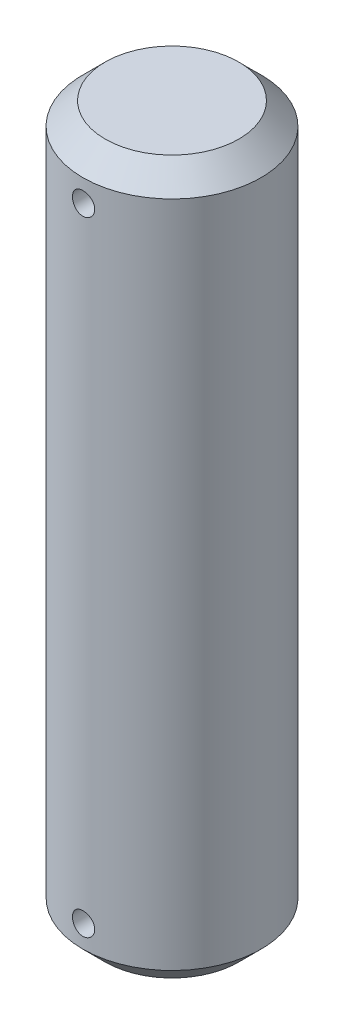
from build123d import *

# Parameters (mm, degrees)
SKETCH1_R           = 12.7
BOSS_EXTRUDE1_DEPTH = 50.8
CHAMFER1_SIZE       = 3.175
SKETCH2_R           = 1.5875
CUT_EXTRUDE1_DEPTH  = 19.05


with BuildPart() as part:
    # Sketch1 → Boss-Extrude1 (new, symmetric)
    with BuildSketch(Plane(origin=(0, 0, 0), x_dir=(1, 0, 0), z_dir=(0, 1, 0))):
        with Locations(Location((0, 0, 0), (0, 0, 270))):
            Circle(SKETCH1_R)
    extrude(amount=BOSS_EXTRUDE1_DEPTH, both=True)

    # Chamfer1
    chamfer1_edges = [part.edges().sort_by_distance(p)[0] for p in [
        (0, -50.8, -12.7),
        (0, 50.8, -12.7),
    ]]
    chamfer(chamfer1_edges, length=CHAMFER1_SIZE)

    # Sketch2 → Cut-Extrude1 (cut, symmetric)
    with BuildSketch(Plane.XY):
        with Locations((0, 44.45)):
            Circle(SKETCH2_R)
        with Locations((0, -44.45)):
            Circle(SKETCH2_R)
    extrude(amount=CUT_EXTRUDE1_DEPTH, both=True, mode=Mode.SUBTRACT)


solid = part.part
